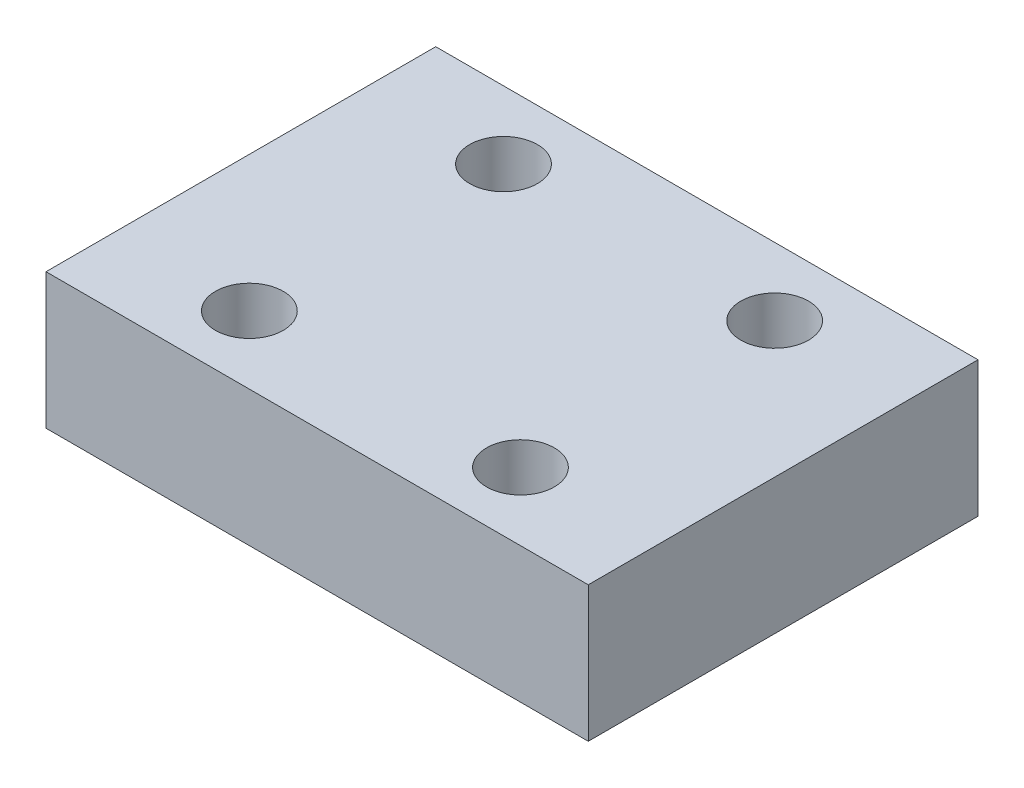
ISO-10303-21;
HEADER;
FILE_DESCRIPTION(('STEP AP214'),'2;1');
FILE_NAME('part.step','',(''),(''),'','','');
FILE_SCHEMA(('AUTOMOTIVE_DESIGN { 1 0 10303 214 1 1 1 1 }'));
ENDSEC;
DATA;
#1=APPLICATION_CONTEXT('core data for automotive mechanical design processes');
#2=APPLICATION_PROTOCOL_DEFINITION('international standard','automotive_design',2000,#1);
#3=PRODUCT_CONTEXT('',#1,'mechanical');
#4=PRODUCT('Part','Part','',(#3));
#5=PRODUCT_RELATED_PRODUCT_CATEGORY('part','',(#4));
#6=PRODUCT_DEFINITION_FORMATION('','',#4);
#7=PRODUCT_DEFINITION_CONTEXT('part definition',#1,'design');
#8=PRODUCT_DEFINITION('design','',#6,#7);
#9=PRODUCT_DEFINITION_SHAPE('','',#8);
#10=(LENGTH_UNIT() NAMED_UNIT(*) SI_UNIT(.MILLI.,.METRE.));
#11=(NAMED_UNIT(*) PLANE_ANGLE_UNIT() SI_UNIT($,.RADIAN.));
#12=(NAMED_UNIT(*) SI_UNIT($,.STERADIAN.) SOLID_ANGLE_UNIT());
#13=UNCERTAINTY_MEASURE_WITH_UNIT(LENGTH_MEASURE(1.E-05),#10,'distance_accuracy_value','');
#14=(GEOMETRIC_REPRESENTATION_CONTEXT(3) GLOBAL_UNCERTAINTY_ASSIGNED_CONTEXT((#13)) GLOBAL_UNIT_ASSIGNED_CONTEXT((#10,
#11,#12)) REPRESENTATION_CONTEXT('',''));
#15=CARTESIAN_POINT('',(0.,0.,0.));
#16=DIRECTION('',(0.,0.,1.));
#17=DIRECTION('',(1.,0.,0.));
#18=AXIS2_PLACEMENT_3D('',#15,#16,#17);
#19=CARTESIAN_POINT('',(0.,8.,0.));
#20=DIRECTION('',(0.,1.,0.));
#21=DIRECTION('',(0.,0.,1.));
#22=AXIS2_PLACEMENT_3D('',#19,#20,#21);
#23=PLANE('',#22);
#24=CARTESIAN_POINT('',(-10.5121951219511,8.,11.6138211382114));
#25=DIRECTION('',(0.,1.,0.));
#26=DIRECTION('',(0.,0.,1.));
#27=AXIS2_PLACEMENT_3D('',#24,#25,#26);
#28=CIRCLE('',#27,2.);
#29=CARTESIAN_POINT('',(-10.5121951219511,8.,13.6138211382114));
#30=VERTEX_POINT('',#29);
#31=EDGE_CURVE('E123',#30,#30,#28,.T.);
#32=ORIENTED_EDGE('',*,*,#31,.F.);
#33=EDGE_LOOP('',(#32));
#34=FACE_BOUND('',#33,.T.);
#35=CARTESIAN_POINT('',(-10.5121951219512,8.,-3.38617886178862));
#36=DIRECTION('',(0.,1.,0.));
#37=DIRECTION('',(0.,0.,1.));
#38=AXIS2_PLACEMENT_3D('',#35,#36,#37);
#39=CIRCLE('',#38,2.);
#40=CARTESIAN_POINT('',(-10.5121951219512,8.,-1.38617886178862));
#41=VERTEX_POINT('',#40);
#42=EDGE_CURVE('E102',#41,#41,#39,.T.);
#43=ORIENTED_EDGE('',*,*,#42,.F.);
#44=EDGE_LOOP('',(#43));
#45=FACE_BOUND('',#44,.T.);
#46=DIRECTION('',(0.,0.,1.));
#47=VECTOR('',#46,1.);
#48=CARTESIAN_POINT('',(-18.5121951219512,8.,-7.38617886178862));
#49=LINE('',#48,#47);
#50=CARTESIAN_POINT('',(-18.5121951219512,8.,-7.38617886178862));
#51=VERTEX_POINT('',#50);
#52=CARTESIAN_POINT('',(-18.5121951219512,8.,15.6138211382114));
#53=VERTEX_POINT('',#52);
#54=EDGE_CURVE('E87',#51,#53,#49,.T.);
#55=ORIENTED_EDGE('',*,*,#54,.T.);
#56=DIRECTION('',(1.,0.,0.));
#57=VECTOR('',#56,1.);
#58=CARTESIAN_POINT('',(-18.5121951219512,8.,15.6138211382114));
#59=LINE('',#58,#57);
#60=CARTESIAN_POINT('',(13.4878048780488,8.,15.6138211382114));
#61=VERTEX_POINT('',#60);
#62=EDGE_CURVE('E82',#53,#61,#59,.T.);
#63=ORIENTED_EDGE('',*,*,#62,.T.);
#64=DIRECTION('',(0.,0.,-1.));
#65=VECTOR('',#64,1.);
#66=CARTESIAN_POINT('',(13.4878048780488,8.,-7.38617886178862));
#67=LINE('',#66,#65);
#68=CARTESIAN_POINT('',(13.4878048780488,8.,-7.38617886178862));
#69=VERTEX_POINT('',#68);
#70=EDGE_CURVE('E85',#61,#69,#67,.T.);
#71=ORIENTED_EDGE('',*,*,#70,.T.);
#72=DIRECTION('',(-1.,0.,0.));
#73=VECTOR('',#72,1.);
#74=CARTESIAN_POINT('',(-18.5121951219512,8.,-7.38617886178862));
#75=LINE('',#74,#73);
#76=EDGE_CURVE('E52',#69,#51,#75,.T.);
#77=ORIENTED_EDGE('',*,*,#76,.T.);
#78=EDGE_LOOP('',(#55,#63,#71,#77));
#79=FACE_BOUND('',#78,.T.);
#80=CARTESIAN_POINT('',(5.48780487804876,8.,-3.38617886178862));
#81=DIRECTION('',(0.,1.,0.));
#82=DIRECTION('',(0.,0.,1.));
#83=AXIS2_PLACEMENT_3D('',#80,#81,#82);
#84=CIRCLE('',#83,2.);
#85=CARTESIAN_POINT('',(5.48780487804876,8.,-1.38617886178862));
#86=VERTEX_POINT('',#85);
#87=EDGE_CURVE('E117',#86,#86,#84,.T.);
#88=ORIENTED_EDGE('',*,*,#87,.F.);
#89=EDGE_LOOP('',(#88));
#90=FACE_BOUND('',#89,.T.);
#91=CARTESIAN_POINT('',(5.48780487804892,8.,11.6138211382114));
#92=DIRECTION('',(0.,1.,0.));
#93=DIRECTION('',(0.,0.,1.));
#94=AXIS2_PLACEMENT_3D('',#91,#92,#93);
#95=CIRCLE('',#94,2.);
#96=CARTESIAN_POINT('',(5.48780487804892,8.,13.6138211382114));
#97=VERTEX_POINT('',#96);
#98=EDGE_CURVE('E129',#97,#97,#95,.T.);
#99=ORIENTED_EDGE('',*,*,#98,.F.);
#100=EDGE_LOOP('',(#99));
#101=FACE_BOUND('',#100,.T.);
#102=ADVANCED_FACE('F35',(#34,#45,#79,#90,#101),#23,.T.);
#103=CARTESIAN_POINT('',(0.,0.,0.));
#104=DIRECTION('',(0.,1.,0.));
#105=DIRECTION('',(0.,0.,1.));
#106=AXIS2_PLACEMENT_3D('',#103,#104,#105);
#107=PLANE('',#106);
#108=DIRECTION('',(0.,0.,1.));
#109=VECTOR('',#108,1.);
#110=CARTESIAN_POINT('',(-18.5121951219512,0.,-7.38617886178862));
#111=LINE('',#110,#109);
#112=CARTESIAN_POINT('',(-18.5121951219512,0.,-7.38617886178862));
#113=VERTEX_POINT('',#112);
#114=CARTESIAN_POINT('',(-18.5121951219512,0.,15.6138211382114));
#115=VERTEX_POINT('',#114);
#116=EDGE_CURVE('E99',#113,#115,#111,.T.);
#117=ORIENTED_EDGE('',*,*,#116,.F.);
#118=DIRECTION('',(-1.,0.,0.));
#119=VECTOR('',#118,1.);
#120=CARTESIAN_POINT('',(-18.5121951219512,0.,-7.38617886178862));
#121=LINE('',#120,#119);
#122=CARTESIAN_POINT('',(13.4878048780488,0.,-7.38617886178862));
#123=VERTEX_POINT('',#122);
#124=EDGE_CURVE('E75',#123,#113,#121,.T.);
#125=ORIENTED_EDGE('',*,*,#124,.F.);
#126=DIRECTION('',(0.,0.,-1.));
#127=VECTOR('',#126,1.);
#128=CARTESIAN_POINT('',(13.4878048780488,0.,-7.38617886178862));
#129=LINE('',#128,#127);
#130=CARTESIAN_POINT('',(13.4878048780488,0.,15.6138211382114));
#131=VERTEX_POINT('',#130);
#132=EDGE_CURVE('E69',#131,#123,#129,.T.);
#133=ORIENTED_EDGE('',*,*,#132,.F.);
#134=DIRECTION('',(1.,0.,0.));
#135=VECTOR('',#134,1.);
#136=CARTESIAN_POINT('',(-18.5121951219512,0.,15.6138211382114));
#137=LINE('',#136,#135);
#138=EDGE_CURVE('E91',#115,#131,#137,.T.);
#139=ORIENTED_EDGE('',*,*,#138,.F.);
#140=EDGE_LOOP('',(#117,#125,#133,#139));
#141=FACE_BOUND('',#140,.T.);
#142=CARTESIAN_POINT('',(-10.5121951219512,0.,-3.38617886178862));
#143=DIRECTION('',(0.,1.,0.));
#144=DIRECTION('',(0.,0.,1.));
#145=AXIS2_PLACEMENT_3D('',#142,#143,#144);
#146=CIRCLE('',#145,2.);
#147=CARTESIAN_POINT('',(-10.5121951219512,0.,-1.38617886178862));
#148=VERTEX_POINT('',#147);
#149=EDGE_CURVE('E114',#148,#148,#146,.T.);
#150=ORIENTED_EDGE('',*,*,#149,.T.);
#151=EDGE_LOOP('',(#150));
#152=FACE_BOUND('',#151,.T.);
#153=CARTESIAN_POINT('',(5.48780487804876,0.,-3.38617886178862));
#154=DIRECTION('',(0.,1.,0.));
#155=DIRECTION('',(0.,0.,1.));
#156=AXIS2_PLACEMENT_3D('',#153,#154,#155);
#157=CIRCLE('',#156,2.);
#158=CARTESIAN_POINT('',(5.48780487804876,0.,-1.38617886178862));
#159=VERTEX_POINT('',#158);
#160=EDGE_CURVE('E120',#159,#159,#157,.T.);
#161=ORIENTED_EDGE('',*,*,#160,.T.);
#162=EDGE_LOOP('',(#161));
#163=FACE_BOUND('',#162,.T.);
#164=CARTESIAN_POINT('',(-10.5121951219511,0.,11.6138211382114));
#165=DIRECTION('',(0.,1.,0.));
#166=DIRECTION('',(0.,0.,1.));
#167=AXIS2_PLACEMENT_3D('',#164,#165,#166);
#168=CIRCLE('',#167,2.);
#169=CARTESIAN_POINT('',(-10.5121951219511,0.,13.6138211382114));
#170=VERTEX_POINT('',#169);
#171=EDGE_CURVE('E126',#170,#170,#168,.T.);
#172=ORIENTED_EDGE('',*,*,#171,.T.);
#173=EDGE_LOOP('',(#172));
#174=FACE_BOUND('',#173,.T.);
#175=CARTESIAN_POINT('',(5.48780487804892,0.,11.6138211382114));
#176=DIRECTION('',(0.,1.,0.));
#177=DIRECTION('',(0.,0.,1.));
#178=AXIS2_PLACEMENT_3D('',#175,#176,#177);
#179=CIRCLE('',#178,2.);
#180=CARTESIAN_POINT('',(5.48780487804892,0.,13.6138211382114));
#181=VERTEX_POINT('',#180);
#182=EDGE_CURVE('E132',#181,#181,#179,.T.);
#183=ORIENTED_EDGE('',*,*,#182,.T.);
#184=EDGE_LOOP('',(#183));
#185=FACE_BOUND('',#184,.T.);
#186=ADVANCED_FACE('F110',(#141,#152,#163,#174,#185),#107,.F.);
#187=CARTESIAN_POINT('',(-18.5121951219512,8.,-7.38617886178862));
#188=DIRECTION('',(1.,0.,0.));
#189=DIRECTION('',(0.,0.,-1.));
#190=AXIS2_PLACEMENT_3D('',#187,#188,#189);
#191=PLANE('',#190);
#192=ORIENTED_EDGE('',*,*,#116,.T.);
#193=DIRECTION('',(0.,-1.,0.));
#194=VECTOR('',#193,1.);
#195=CARTESIAN_POINT('',(-18.5121951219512,8.,15.6138211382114));
#196=LINE('',#195,#194);
#197=EDGE_CURVE('E11',#53,#115,#196,.T.);
#198=ORIENTED_EDGE('',*,*,#197,.F.);
#199=ORIENTED_EDGE('',*,*,#54,.F.);
#200=DIRECTION('',(0.,-1.,0.));
#201=VECTOR('',#200,1.);
#202=CARTESIAN_POINT('',(-18.5121951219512,8.,-7.38617886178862));
#203=LINE('',#202,#201);
#204=EDGE_CURVE('E95',#51,#113,#203,.T.);
#205=ORIENTED_EDGE('',*,*,#204,.T.);
#206=EDGE_LOOP('',(#192,#198,#199,#205));
#207=FACE_BOUND('',#206,.T.);
#208=ADVANCED_FACE('F37',(#207),#191,.F.);
#209=CARTESIAN_POINT('',(-18.5121951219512,8.,15.6138211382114));
#210=DIRECTION('',(0.,0.,-1.));
#211=DIRECTION('',(-1.,0.,0.));
#212=AXIS2_PLACEMENT_3D('',#209,#210,#211);
#213=PLANE('',#212);
#214=ORIENTED_EDGE('',*,*,#138,.T.);
#215=DIRECTION('',(0.,-1.,0.));
#216=VECTOR('',#215,1.);
#217=CARTESIAN_POINT('',(13.4878048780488,8.,15.6138211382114));
#218=LINE('',#217,#216);
#219=EDGE_CURVE('E44',#61,#131,#218,.T.);
#220=ORIENTED_EDGE('',*,*,#219,.F.);
#221=ORIENTED_EDGE('',*,*,#62,.F.);
#222=ORIENTED_EDGE('',*,*,#197,.T.);
#223=EDGE_LOOP('',(#214,#220,#221,#222));
#224=FACE_BOUND('',#223,.T.);
#225=ADVANCED_FACE('F90',(#224),#213,.F.);
#226=CARTESIAN_POINT('',(13.4878048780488,8.,-7.38617886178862));
#227=DIRECTION('',(-1.,0.,0.));
#228=DIRECTION('',(0.,0.,1.));
#229=AXIS2_PLACEMENT_3D('',#226,#227,#228);
#230=PLANE('',#229);
#231=ORIENTED_EDGE('',*,*,#132,.T.);
#232=DIRECTION('',(0.,-1.,0.));
#233=VECTOR('',#232,1.);
#234=CARTESIAN_POINT('',(13.4878048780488,8.,-7.38617886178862));
#235=LINE('',#234,#233);
#236=EDGE_CURVE('E92',#69,#123,#235,.T.);
#237=ORIENTED_EDGE('',*,*,#236,.F.);
#238=ORIENTED_EDGE('',*,*,#70,.F.);
#239=ORIENTED_EDGE('',*,*,#219,.T.);
#240=EDGE_LOOP('',(#231,#237,#238,#239));
#241=FACE_BOUND('',#240,.T.);
#242=ADVANCED_FACE('F93',(#241),#230,.F.);
#243=CARTESIAN_POINT('',(-18.5121951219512,8.,-7.38617886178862));
#244=DIRECTION('',(0.,0.,1.));
#245=DIRECTION('',(1.,0.,0.));
#246=AXIS2_PLACEMENT_3D('',#243,#244,#245);
#247=PLANE('',#246);
#248=ORIENTED_EDGE('',*,*,#124,.T.);
#249=ORIENTED_EDGE('',*,*,#204,.F.);
#250=ORIENTED_EDGE('',*,*,#76,.F.);
#251=ORIENTED_EDGE('',*,*,#236,.T.);
#252=EDGE_LOOP('',(#248,#249,#250,#251));
#253=FACE_BOUND('',#252,.T.);
#254=ADVANCED_FACE('F107',(#253),#247,.F.);
#255=CARTESIAN_POINT('',(-10.5121951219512,8.,-3.38617886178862));
#256=DIRECTION('',(0.,-1.,0.));
#257=DIRECTION('',(0.,0.,-1.));
#258=AXIS2_PLACEMENT_3D('',#255,#256,#257);
#259=CYLINDRICAL_SURFACE('',#258,2.);
#260=ORIENTED_EDGE('',*,*,#42,.T.);
#261=EDGE_LOOP('',(#260));
#262=FACE_BOUND('',#261,.T.);
#263=ORIENTED_EDGE('',*,*,#149,.F.);
#264=EDGE_LOOP('',(#263));
#265=FACE_BOUND('',#264,.T.);
#266=ADVANCED_FACE('F151',(#262,#265),#259,.F.);
#267=CARTESIAN_POINT('',(5.48780487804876,8.,-3.38617886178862));
#268=DIRECTION('',(0.,-1.,0.));
#269=DIRECTION('',(0.,0.,-1.));
#270=AXIS2_PLACEMENT_3D('',#267,#268,#269);
#271=CYLINDRICAL_SURFACE('',#270,2.);
#272=ORIENTED_EDGE('',*,*,#87,.T.);
#273=EDGE_LOOP('',(#272));
#274=FACE_BOUND('',#273,.T.);
#275=ORIENTED_EDGE('',*,*,#160,.F.);
#276=EDGE_LOOP('',(#275));
#277=FACE_BOUND('',#276,.T.);
#278=ADVANCED_FACE('F197',(#274,#277),#271,.F.);
#279=CARTESIAN_POINT('',(-10.5121951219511,8.,11.6138211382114));
#280=DIRECTION('',(0.,-1.,0.));
#281=DIRECTION('',(0.,0.,-1.));
#282=AXIS2_PLACEMENT_3D('',#279,#280,#281);
#283=CYLINDRICAL_SURFACE('',#282,2.);
#284=ORIENTED_EDGE('',*,*,#31,.T.);
#285=EDGE_LOOP('',(#284));
#286=FACE_BOUND('',#285,.T.);
#287=ORIENTED_EDGE('',*,*,#171,.F.);
#288=EDGE_LOOP('',(#287));
#289=FACE_BOUND('',#288,.T.);
#290=ADVANCED_FACE('F205',(#286,#289),#283,.F.);
#291=CARTESIAN_POINT('',(5.48780487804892,8.,11.6138211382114));
#292=DIRECTION('',(0.,-1.,0.));
#293=DIRECTION('',(0.,0.,-1.));
#294=AXIS2_PLACEMENT_3D('',#291,#292,#293);
#295=CYLINDRICAL_SURFACE('',#294,2.);
#296=ORIENTED_EDGE('',*,*,#98,.T.);
#297=EDGE_LOOP('',(#296));
#298=FACE_BOUND('',#297,.T.);
#299=ORIENTED_EDGE('',*,*,#182,.F.);
#300=EDGE_LOOP('',(#299));
#301=FACE_BOUND('',#300,.T.);
#302=ADVANCED_FACE('F138',(#298,#301),#295,.F.);
#303=CLOSED_SHELL('',(#102,#186,#208,#225,#242,#254,#266,#278,#290,#302));
#304=MANIFOLD_SOLID_BREP('B2',#303);
#305=ADVANCED_BREP_SHAPE_REPRESENTATION('',(#18,#304),#14);
#306=SHAPE_DEFINITION_REPRESENTATION(#9,#305);
ENDSEC;
END-ISO-10303-21;
